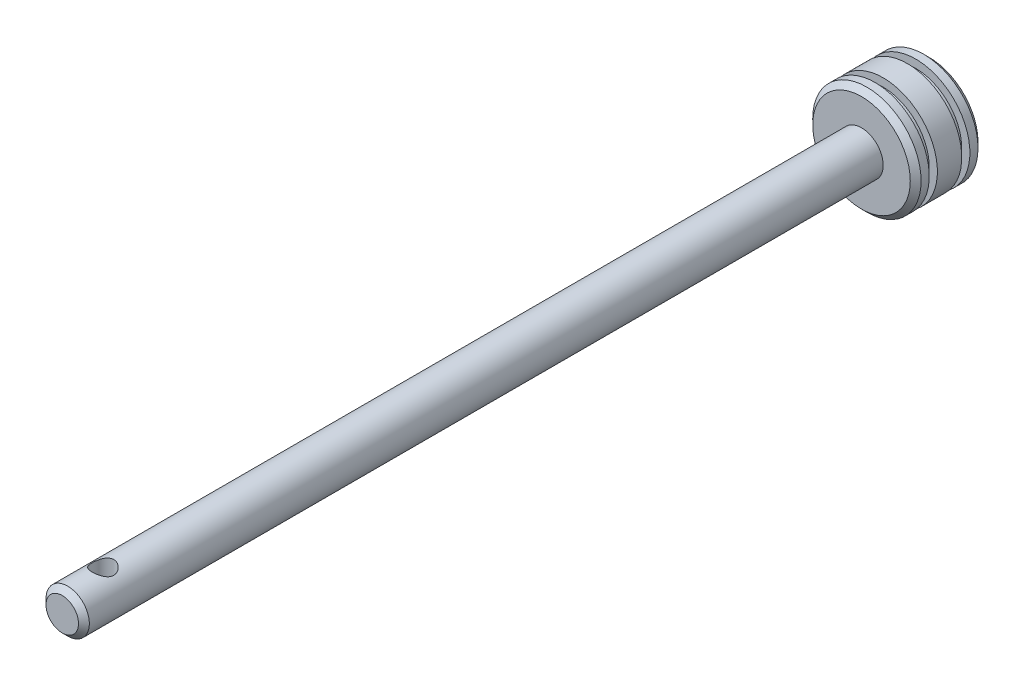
from build123d import *

# Parameters (mm, degrees)
ESQUISSE1_R                  = 20
BASE_EXTRUSION_DEPTH         = 25
ESQUISSE2_R                  = 8
BOSS_EXTRU_1_DEPTH           = 295
CHANFREIN1_SIZE              = 2
ESQUISSE3_W                  = 3
ESQUISSE3_H                  = 3
CHANFREIN2_SIZE              = 2
ENL_V_MAT_EXTRU_1_DEPTH      = 322.247568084
ENL_V_MAT_EXTRU_1_DEPTH_BACK = 322.247568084
ESQUISSE4_R                  = 4


with BuildPart() as part:
    # Esquisse1 → Base-Extrusion (new body)
    with BuildSketch(Plane.XY):
        Circle(ESQUISSE1_R)
    extrude(amount=BASE_EXTRUSION_DEPTH)

    # Esquisse2 → Boss.-Extru.1 (add)
    with BuildSketch(Plane.XY.offset(25)):
        Circle(ESQUISSE2_R)
    extrude(amount=BOSS_EXTRU_1_DEPTH)

    # Chanfrein1
    chanfrein1_edges = [part.edges().sort_by_distance(p)[0] for p in [
        (-20, 0, 0),
        (-20, 0, 25),
    ]]
    chamfer(chanfrein1_edges, length=CHANFREIN1_SIZE)

    # Esquisse3 → Enl_vement de mati_re-R_volution2 (revolve, cut)
    with BuildSketch(Plane(origin=(0, 0, 0), x_dir=(0, 0, -1), z_dir=(1, 0, 0)), mode=Mode.PRIVATE) as enl_vement_de_mati_re_r_volution2_sk:
        with Locations((-18.5, 18.5)):
            Rectangle(ESQUISSE3_W, ESQUISSE3_H)
        with Locations((-6.5, 18.5)):
            Rectangle(ESQUISSE3_W, ESQUISSE3_H)
    revolve(enl_vement_de_mati_re_r_volution2_sk.sketch.rotate(Axis((0, 0, 0), (0, 0, 1)), 90), axis=Axis((0, 0, 0), (0, 0, 1)), mode=Mode.SUBTRACT)

    # Chanfrein2
    chanfrein2_edges = [part.edges().sort_by_distance(p)[0] for p in [
        (-8, 0, 320),
    ]]
    chamfer(chanfrein2_edges, length=CHANFREIN2_SIZE)

    # Esquisse4 → Enl_v. mat.-Extru.1 (cut, two sides: drawn at the far end of the back side and taken through both)
    with BuildSketch(Plane(origin=(0, 0, 0), x_dir=(1, 0, 0), z_dir=(0, 1, 0)).offset(-ENL_V_MAT_EXTRU_1_DEPTH_BACK)):
        with Locations(Location((0, -305, 0), (0, 0, 270))):
            Circle(ESQUISSE4_R)
    extrude(amount=ENL_V_MAT_EXTRU_1_DEPTH + ENL_V_MAT_EXTRU_1_DEPTH_BACK, mode=Mode.SUBTRACT)


solid = part.part
